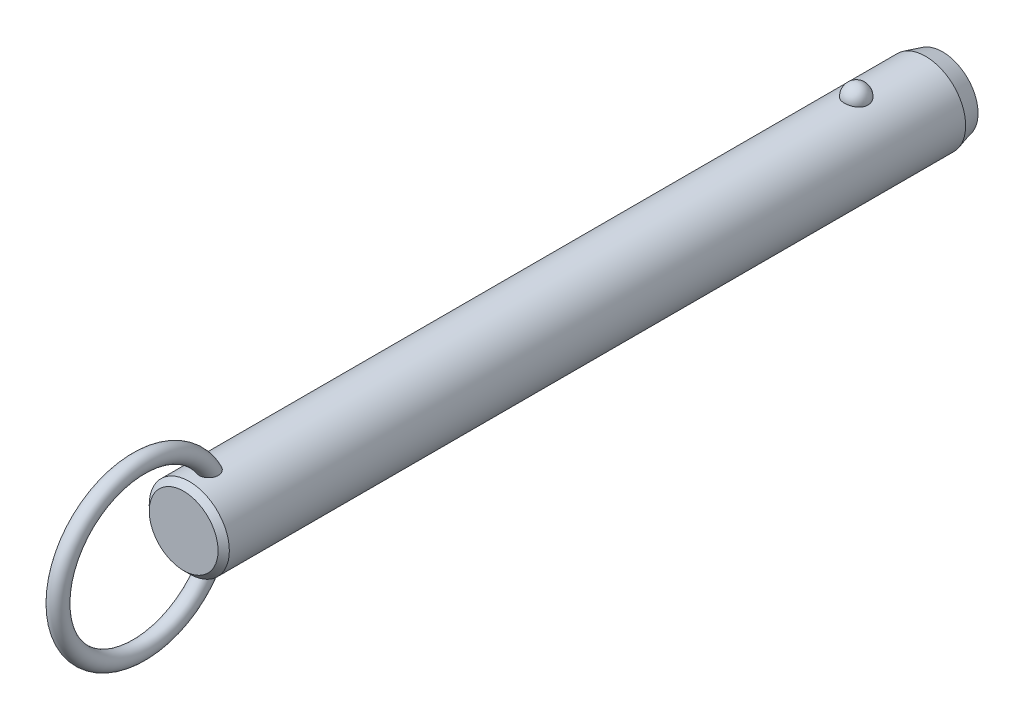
ISO-10303-21;
HEADER;
FILE_DESCRIPTION(('STEP AP214'),'2;1');
FILE_NAME('part.step','',(''),(''),'','','');
FILE_SCHEMA(('AUTOMOTIVE_DESIGN { 1 0 10303 214 1 1 1 1 }'));
ENDSEC;
DATA;
#1=APPLICATION_CONTEXT('core data for automotive mechanical design processes');
#2=APPLICATION_PROTOCOL_DEFINITION('international standard','automotive_design',2000,#1);
#3=PRODUCT_CONTEXT('',#1,'mechanical');
#4=PRODUCT('Part','Part','',(#3));
#5=PRODUCT_RELATED_PRODUCT_CATEGORY('part','',(#4));
#6=PRODUCT_DEFINITION_FORMATION('','',#4);
#7=PRODUCT_DEFINITION_CONTEXT('part definition',#1,'design');
#8=PRODUCT_DEFINITION('design','',#6,#7);
#9=PRODUCT_DEFINITION_SHAPE('','',#8);
#10=(LENGTH_UNIT() NAMED_UNIT(*) SI_UNIT(.MILLI.,.METRE.));
#11=(NAMED_UNIT(*) PLANE_ANGLE_UNIT() SI_UNIT($,.RADIAN.));
#12=(NAMED_UNIT(*) SI_UNIT($,.STERADIAN.) SOLID_ANGLE_UNIT());
#13=UNCERTAINTY_MEASURE_WITH_UNIT(LENGTH_MEASURE(1.E-05),#10,'distance_accuracy_value','');
#14=(GEOMETRIC_REPRESENTATION_CONTEXT(3) GLOBAL_UNCERTAINTY_ASSIGNED_CONTEXT((#13)) GLOBAL_UNIT_ASSIGNED_CONTEXT((#10,
#11,#12)) REPRESENTATION_CONTEXT('',''));
#15=CARTESIAN_POINT('',(0.,0.,0.));
#16=DIRECTION('',(0.,0.,1.));
#17=DIRECTION('',(1.,0.,0.));
#18=AXIS2_PLACEMENT_3D('',#15,#16,#17);
#19=CARTESIAN_POINT('',(0.,0.,109.2));
#20=DIRECTION('',(0.,0.,-1.));
#21=DIRECTION('',(-1.,0.,0.));
#22=AXIS2_PLACEMENT_3D('',#19,#20,#21);
#23=CYLINDRICAL_SURFACE('',#22,7.1);
#24=CARTESIAN_POINT('',(2.0769088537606,6.78943661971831,-2.1));
#25=CARTESIAN_POINT('',(2.07690739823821,6.78943796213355,-1.98268154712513));
#26=CARTESIAN_POINT('',(2.06738130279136,6.79237331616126,-1.86534506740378));
#27=CARTESIAN_POINT('',(2.0295040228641,6.8037853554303,-1.63400788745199));
#28=CARTESIAN_POINT('',(2.00114757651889,6.81226358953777,-1.52000812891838));
#29=CARTESIAN_POINT('',(1.92632025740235,6.83379798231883,-1.29863433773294));
#30=CARTESIAN_POINT('',(1.87985726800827,6.84685214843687,-1.19125744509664));
#31=CARTESIAN_POINT('',(1.76995205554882,6.87608091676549,-0.98604657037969));
#32=CARTESIAN_POINT('',(1.70650980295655,6.8922555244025,-0.88821260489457));
#33=CARTESIAN_POINT('',(1.5638119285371,6.92602930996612,-0.704242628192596));
#34=CARTESIAN_POINT('',(1.4844714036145,6.94363582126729,-0.618173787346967));
#35=CARTESIAN_POINT('',(1.31221746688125,6.97823658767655,-0.460740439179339));
#36=CARTESIAN_POINT('',(1.21930409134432,6.99523084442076,-0.389375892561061));
#37=CARTESIAN_POINT('',(1.02268781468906,7.02666176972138,-0.263547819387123));
#38=CARTESIAN_POINT('',(0.91902009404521,7.04110638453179,-0.209031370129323));
#39=CARTESIAN_POINT('',(0.703548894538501,7.06588726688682,-0.118163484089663));
#40=CARTESIAN_POINT('',(0.591746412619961,7.07622403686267,-0.0818098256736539));
#41=CARTESIAN_POINT('',(0.365557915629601,7.09147068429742,-0.0288711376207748));
#42=CARTESIAN_POINT('',(0.251267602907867,7.09648447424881,-0.0119070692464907));
#43=CARTESIAN_POINT('',(0.0213499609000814,7.10089837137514,0.00304925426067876));
#44=CARTESIAN_POINT('',(-0.0942772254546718,7.10029907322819,0.00104351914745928));
#45=CARTESIAN_POINT('',(-0.321651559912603,7.09360829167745,-0.0216931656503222));
#46=CARTESIAN_POINT('',(-0.433431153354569,7.08760388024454,-0.0421272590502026));
#47=CARTESIAN_POINT('',(-0.651862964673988,7.07086131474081,-0.100729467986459));
#48=CARTESIAN_POINT('',(-0.758515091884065,7.06012307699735,-0.138897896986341));
#49=CARTESIAN_POINT('',(-0.964449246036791,7.03496097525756,-0.232213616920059));
#50=CARTESIAN_POINT('',(-1.06368095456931,7.02051445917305,-0.287465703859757));
#51=CARTESIAN_POINT('',(-1.25145353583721,6.98948740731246,-0.413383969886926));
#52=CARTESIAN_POINT('',(-1.33999321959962,6.97290663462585,-0.48405186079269));
#53=CARTESIAN_POINT('',(-1.50591604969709,6.93898770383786,-0.640594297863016));
#54=CARTESIAN_POINT('',(-1.58302488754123,6.92164094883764,-0.726757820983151));
#55=CARTESIAN_POINT('',(-1.72189320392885,6.8884103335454,-0.91092752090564));
#56=CARTESIAN_POINT('',(-1.78365144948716,6.87252659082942,-1.008934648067));
#57=CARTESIAN_POINT('',(-1.89101272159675,6.84377189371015,-1.21549497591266));
#58=CARTESIAN_POINT('',(-1.93639553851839,6.83094274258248,-1.32416860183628));
#59=CARTESIAN_POINT('',(-2.00874275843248,6.81002070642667,-1.54791500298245));
#60=CARTESIAN_POINT('',(-2.03570774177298,6.80192767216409,-1.66298757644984));
#61=CARTESIAN_POINT('',(-2.07047276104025,6.7914266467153,-1.89571453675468));
#62=CARTESIAN_POINT('',(-2.07835878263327,6.78899315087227,-2.01335491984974));
#63=CARTESIAN_POINT('',(-2.07502083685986,6.79001409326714,-2.24833570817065));
#64=CARTESIAN_POINT('',(-2.06379746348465,6.7934683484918,-2.36567612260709));
#65=CARTESIAN_POINT('',(-2.02263913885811,6.80583442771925,-2.59603194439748));
#66=CARTESIAN_POINT('',(-1.99281127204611,6.81471501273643,-2.70906820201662));
#67=CARTESIAN_POINT('',(-1.91526639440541,6.83691232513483,-2.92836575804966));
#68=CARTESIAN_POINT('',(-1.8675486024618,6.85022924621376,-3.03462676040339));
#69=CARTESIAN_POINT('',(-1.75504492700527,6.87991336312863,-3.23806487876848));
#70=CARTESIAN_POINT('',(-1.69015924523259,6.89629822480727,-3.33518422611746));
#71=CARTESIAN_POINT('',(-1.54505404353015,6.93024852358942,-3.51697105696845));
#72=CARTESIAN_POINT('',(-1.46483385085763,6.94781401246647,-3.60163799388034));
#73=CARTESIAN_POINT('',(-1.29071406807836,6.98225977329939,-3.75654119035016));
#74=CARTESIAN_POINT('',(-1.19675650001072,6.99913673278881,-3.82671308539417));
#75=CARTESIAN_POINT('',(-0.997940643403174,7.03023618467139,-3.9501837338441));
#76=CARTESIAN_POINT('',(-0.89308318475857,7.04445887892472,-4.00348377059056));
#77=CARTESIAN_POINT('',(-0.676902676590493,7.06848365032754,-4.09107242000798));
#78=CARTESIAN_POINT('',(-0.565686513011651,7.0783430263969,-4.12560889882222));
#79=CARTESIAN_POINT('',(-0.338739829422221,7.09282534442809,-4.17575450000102));
#80=CARTESIAN_POINT('',(-0.223009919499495,7.09744899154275,-4.19136617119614));
#81=CARTESIAN_POINT('',(0.00707628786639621,7.10090930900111,-4.20307965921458));
#82=CARTESIAN_POINT('',(0.121410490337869,7.09986531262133,-4.19958377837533));
#83=CARTESIAN_POINT('',(0.347815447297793,7.092380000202,-4.17411564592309));
#84=CARTESIAN_POINT('',(0.459886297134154,7.08593891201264,-4.15214417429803));
#85=CARTESIAN_POINT('',(0.678084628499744,7.06838983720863,-4.09049562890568));
#86=CARTESIAN_POINT('',(0.784237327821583,7.05730369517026,-4.05090137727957));
#87=CARTESIAN_POINT('',(0.988305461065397,7.03163139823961,-3.95511447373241));
#88=CARTESIAN_POINT('',(1.08622031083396,7.01704499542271,-3.89892064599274));
#89=CARTESIAN_POINT('',(1.27284490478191,6.98562668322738,-3.77035541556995));
#90=CARTESIAN_POINT('',(1.36137372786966,6.96876135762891,-3.69772964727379));
#91=CARTESIAN_POINT('',(1.52509486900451,6.93477412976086,-3.53878279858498));
#92=CARTESIAN_POINT('',(1.60028496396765,6.91765218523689,-3.45245943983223));
#93=CARTESIAN_POINT('',(1.73681688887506,6.88465753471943,-3.26658774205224));
#94=CARTESIAN_POINT('',(1.79785966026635,6.86881574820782,-3.16681408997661));
#95=CARTESIAN_POINT('',(1.90265327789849,6.84053157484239,-2.95814408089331));
#96=CARTESIAN_POINT('',(1.94640861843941,6.82808830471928,-2.84925010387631));
#97=CARTESIAN_POINT('',(2.01274378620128,6.80881460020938,-2.63454318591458));
#98=CARTESIAN_POINT('',(2.03676193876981,6.80160856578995,-2.52920574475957));
#99=CARTESIAN_POINT('',(2.06884490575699,6.79191902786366,-2.3159172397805));
#100=CARTESIAN_POINT('',(2.07691019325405,6.78943538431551,-2.20796625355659));
#101=CARTESIAN_POINT('',(2.0769088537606,6.78943661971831,-2.1));
#102=B_SPLINE_CURVE_WITH_KNOTS('',3,(#24,#25,#26,#27,#28,#29,#30,#31,#32,#33,#34,#35,#36,#37,
#38,#39,#40,#41,#42,#43,#44,#45,#46,#47,#48,#49,#50,#51,#52,#53,#54,#55,#56,#57,#58,#59,#60,#61,
#62,#63,#64,#65,#66,#67,#68,#69,#70,#71,#72,#73,#74,#75,#76,#77,#78,#79,#80,#81,#82,#83,#84,#85,
#86,#87,#88,#89,#90,#91,#92,#93,#94,#95,#96,#97,#98,#99,#100,#101),.UNSPECIFIED.,.T.,.F.,(4,2,2,
2,2,2,2,2,2,2,2,2,2,2,2,2,2,2,2,2,2,2,2,2,2,2,2,2,2,2,2,2,2,2,2,2,2,2,4),(0.,0.351568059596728,
0.703234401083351,1.05474780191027,1.40626181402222,1.75970563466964,2.11314851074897,
2.4654696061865,2.81774759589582,3.16301449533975,3.50824481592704,3.84801136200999,
4.18778391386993,4.52968352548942,4.87162112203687,5.22076181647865,5.56993054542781,
5.92363364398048,6.27732559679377,6.62942052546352,6.98150450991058,7.33158042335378,
7.68167162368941,8.03384443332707,8.38603269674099,8.73975272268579,9.09344583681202,
9.44234545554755,9.79119807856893,10.1327344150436,10.4742563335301,10.8141898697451,
11.1541474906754,11.4997793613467,11.8454687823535,12.1979079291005,12.5502553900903,
12.8738073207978,13.1973496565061),.UNSPECIFIED.);
#103=CARTESIAN_POINT('',(2.0769088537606,6.78943661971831,-2.1));
#104=VERTEX_POINT('',#103);
#105=EDGE_CURVE('E41',#104,#104,#102,.T.);
#106=ORIENTED_EDGE('',*,*,#105,.T.);
#107=EDGE_LOOP('',(#106));
#108=FACE_BOUND('',#107,.T.);
#109=CARTESIAN_POINT('',(0.,0.,116.12));
#110=DIRECTION('',(0.,0.,1.));
#111=DIRECTION('',(1.,0.,0.));
#112=AXIS2_PLACEMENT_3D('',#109,#110,#111);
#113=CIRCLE('',#112,7.1);
#114=CARTESIAN_POINT('',(7.1,0.,116.12));
#115=VERTEX_POINT('',#114);
#116=EDGE_CURVE('E10',#115,#115,#113,.F.);
#117=ORIENTED_EDGE('',*,*,#116,.T.);
#118=EDGE_LOOP('',(#117));
#119=FACE_BOUND('',#118,.T.);
#120=CARTESIAN_POINT('',(-0.429539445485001,-7.08699541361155,110.942921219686));
#121=CARTESIAN_POINT('',(-0.508331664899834,-7.08221999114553,110.966876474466));
#122=CARTESIAN_POINT('',(-0.585039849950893,-7.07624016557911,110.997457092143));
#123=CARTESIAN_POINT('',(-0.732082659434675,-7.06254296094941,111.071024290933));
#124=CARTESIAN_POINT('',(-0.802417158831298,-7.05482554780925,111.114011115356));
#125=CARTESIAN_POINT('',(-0.934722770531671,-7.03851844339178,111.211113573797));
#126=CARTESIAN_POINT('',(-0.996700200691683,-7.02992941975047,111.265220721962));
#127=CARTESIAN_POINT('',(-1.11079942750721,-7.01280697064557,111.382967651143));
#128=CARTESIAN_POINT('',(-1.16292136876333,-7.00427354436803,111.446607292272));
#129=CARTESIAN_POINT('',(-1.25705660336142,-6.98799959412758,111.582687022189));
#130=CARTESIAN_POINT('',(-1.29888032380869,-6.98027525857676,111.655259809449));
#131=CARTESIAN_POINT('',(-1.37069920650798,-6.96652886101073,111.806168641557));
#132=CARTESIAN_POINT('',(-1.40069157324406,-6.96050720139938,111.884506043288));
#133=CARTESIAN_POINT('',(-1.45043507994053,-6.95031881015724,112.050190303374));
#134=CARTESIAN_POINT('',(-1.46937115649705,-6.94630231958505,112.137789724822));
#135=CARTESIAN_POINT('',(-1.49424917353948,-6.94099239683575,112.314871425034));
#136=CARTESIAN_POINT('',(-1.50018601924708,-6.93970003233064,112.404354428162));
#137=CARTESIAN_POINT('',(-1.49978214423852,-6.93978815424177,112.594060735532));
#138=CARTESIAN_POINT('',(-1.49187639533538,-6.94150934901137,112.694279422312));
#139=CARTESIAN_POINT('',(-1.46177925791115,-6.94790814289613,112.892479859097));
#140=CARTESIAN_POINT('',(-1.43957541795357,-6.95258831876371,112.990459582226));
#141=CARTESIAN_POINT('',(-1.37783293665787,-6.96510647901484,113.19536292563));
#142=CARTESIAN_POINT('',(-1.33634073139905,-6.97328848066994,113.301680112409));
#143=CARTESIAN_POINT('',(-1.23686994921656,-6.99161706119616,113.506177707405));
#144=CARTESIAN_POINT('',(-1.17889192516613,-7.00176357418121,113.604358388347));
#145=CARTESIAN_POINT('',(-1.05875124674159,-7.02082898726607,113.772374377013));
#146=CARTESIAN_POINT('',(-0.999247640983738,-7.02963746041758,113.844123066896));
#147=CARTESIAN_POINT('',(-0.869494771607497,-7.04686074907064,113.977195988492));
#148=CARTESIAN_POINT('',(-0.799263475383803,-7.05527619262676,114.038537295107));
#149=CARTESIAN_POINT('',(-0.665408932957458,-7.06899457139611,114.135131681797));
#150=CARTESIAN_POINT('',(-0.603817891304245,-7.07457275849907,114.173151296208));
#151=CARTESIAN_POINT('',(-0.47517283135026,-7.08437420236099,114.238758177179));
#152=CARTESIAN_POINT('',(-0.408123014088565,-7.08859848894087,114.266353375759));
#153=CARTESIAN_POINT('',(-0.269431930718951,-7.09522749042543,114.309256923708));
#154=CARTESIAN_POINT('',(-0.19775731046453,-7.09761688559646,114.324461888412));
#155=CARTESIAN_POINT('',(-0.0527849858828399,-7.10017268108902,114.340716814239));
#156=CARTESIAN_POINT('',(0.0205115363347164,-7.10034065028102,114.341776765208));
#157=CARTESIAN_POINT('',(0.156426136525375,-7.09855986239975,114.330461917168));
#158=CARTESIAN_POINT('',(0.219199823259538,-7.09688191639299,114.319806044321));
#159=CARTESIAN_POINT('',(0.342134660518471,-7.09201880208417,114.288537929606));
#160=CARTESIAN_POINT('',(0.402295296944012,-7.08883333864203,114.267923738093));
#161=CARTESIAN_POINT('',(0.520687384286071,-7.08113868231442,114.217212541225));
#162=CARTESIAN_POINT('',(0.57879126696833,-7.07658958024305,114.186827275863));
#163=CARTESIAN_POINT('',(0.690173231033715,-7.06659708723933,114.118367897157));
#164=CARTESIAN_POINT('',(0.74344785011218,-7.061153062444,114.080288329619));
#165=CARTESIAN_POINT('',(0.870947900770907,-7.04680292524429,113.976592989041));
#166=CARTESIAN_POINT('',(0.941828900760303,-7.0375580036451,113.906897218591));
#167=CARTESIAN_POINT('',(1.07136606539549,-7.01900793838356,113.756945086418));
#168=CARTESIAN_POINT('',(1.13000013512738,-7.00970271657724,113.676670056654));
#169=CARTESIAN_POINT('',(1.23579584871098,-6.99183327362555,113.506899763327));
#170=CARTESIAN_POINT('',(1.28274271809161,-6.98328455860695,113.417269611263));
#171=CARTESIAN_POINT('',(1.36351442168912,-6.96796352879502,113.232176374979));
#172=CARTESIAN_POINT('',(1.39733971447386,-6.96119115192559,113.136713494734));
#173=CARTESIAN_POINT('',(1.45579181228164,-6.94922464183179,112.92530928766));
#174=CARTESIAN_POINT('',(1.47790145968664,-6.94449000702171,112.808631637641));
#175=CARTESIAN_POINT('',(1.50168752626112,-6.93938731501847,112.573015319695));
#176=CARTESIAN_POINT('',(1.50336085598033,-6.93901991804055,112.45407631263));
#177=CARTESIAN_POINT('',(1.48486516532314,-6.9430010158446,112.22360799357));
#178=CARTESIAN_POINT('',(1.46573441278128,-6.9471253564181,112.111995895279));
#179=CARTESIAN_POINT('',(1.40606892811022,-6.95944667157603,111.894886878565));
#180=CARTESIAN_POINT('',(1.36556446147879,-6.96763788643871,111.7893815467));
#181=CARTESIAN_POINT('',(1.27082700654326,-6.98548038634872,111.604287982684));
#182=CARTESIAN_POINT('',(1.21949810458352,-6.99473841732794,111.523171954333));
#183=CARTESIAN_POINT('',(1.10242050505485,-7.01414069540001,111.372227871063));
#184=CARTESIAN_POINT('',(1.0366811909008,-7.02428436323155,111.30239252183));
#185=CARTESIAN_POINT('',(0.900559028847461,-7.04295285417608,111.183573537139));
#186=CARTESIAN_POINT('',(0.831428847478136,-7.05153466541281,111.133157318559));
#187=CARTESIAN_POINT('',(0.685291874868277,-7.06723150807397,111.045142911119));
#188=CARTESIAN_POINT('',(0.608287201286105,-7.0743469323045,111.007541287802));
#189=CARTESIAN_POINT('',(0.451878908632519,-7.08602232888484,110.947491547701));
#190=CARTESIAN_POINT('',(0.372686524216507,-7.09067127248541,110.924508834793));
#191=CARTESIAN_POINT('',(0.211477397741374,-7.09730788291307,110.892035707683));
#192=CARTESIAN_POINT('',(0.12946098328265,-7.09929585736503,110.88254373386));
#193=CARTESIAN_POINT('',(-0.0332905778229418,-7.10037858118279,110.877351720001));
#194=CARTESIAN_POINT('',(-0.114016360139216,-7.09953334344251,110.881365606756));
#195=CARTESIAN_POINT('',(-0.273670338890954,-7.09517338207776,110.902454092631));
#196=CARTESIAN_POINT('',(-0.352598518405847,-7.09165863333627,110.919528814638));
#197=CARTESIAN_POINT('',(-0.429539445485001,-7.08699541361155,110.942921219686));
#198=B_SPLINE_CURVE_WITH_KNOTS('',3,(#120,#121,#122,#123,#124,#125,#126,#127,#128,#129,#130,
#131,#132,#133,#134,#135,#136,#137,#138,#139,#140,#141,#142,#143,#144,#145,#146,#147,#148,#149,
#150,#151,#152,#153,#154,#155,#156,#157,#158,#159,#160,#161,#162,#163,#164,#165,#166,#167,#168,
#169,#170,#171,#172,#173,#174,#175,#176,#177,#178,#179,#180,#181,#182,#183,#184,#185,#186,#187,
#188,#189,#190,#191,#192,#193,#194,#195,#196,#197),.UNSPECIFIED.,.T.,.F.,(4,2,2,2,2,2,2,2,2,2,2,
2,2,2,2,2,2,2,2,2,2,2,2,2,2,2,2,2,2,2,2,2,2,2,2,2,2,2,4),(0.,0.247183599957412,
0.494372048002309,0.741372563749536,0.988369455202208,1.23962059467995,1.49093106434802,
1.75897818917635,2.02713035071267,2.32758265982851,2.62829697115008,2.97008736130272,
3.31186629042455,3.59175319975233,3.87117637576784,4.08813841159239,4.30493502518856,
4.52352259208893,4.7419557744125,4.93215328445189,5.12238804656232,5.31884850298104,
5.51544871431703,5.8133231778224,6.11173048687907,6.41527266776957,6.71880423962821,
7.073581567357,7.42841252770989,7.76631485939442,8.10373999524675,8.39142246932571,
8.67891817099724,8.93560332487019,9.19221962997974,9.43881106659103,9.68537399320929,
9.92674752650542,10.1681233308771),.UNSPECIFIED.);
#199=CARTESIAN_POINT('',(-0.429539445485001,-7.08699541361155,110.942921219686));
#200=VERTEX_POINT('',#199);
#201=EDGE_CURVE('E60',#200,#200,#198,.T.);
#202=ORIENTED_EDGE('',*,*,#201,.T.);
#203=EDGE_LOOP('',(#202));
#204=FACE_BOUND('',#203,.T.);
#205=CARTESIAN_POINT('',(-0.429539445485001,7.08699541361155,110.942921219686));
#206=CARTESIAN_POINT('',(-0.351665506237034,7.09171429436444,110.919246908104));
#207=CARTESIAN_POINT('',(-0.271733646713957,7.09525896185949,110.902036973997));
#208=CARTESIAN_POINT('',(-0.110026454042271,7.09960839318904,110.881005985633));
#209=CARTESIAN_POINT('',(-0.0282502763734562,7.10041187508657,110.877191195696));
#210=CARTESIAN_POINT('',(0.134782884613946,7.09918849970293,110.883059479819));
#211=CARTESIAN_POINT('',(0.21603995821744,7.09716214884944,110.89274013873));
#212=CARTESIAN_POINT('',(0.375730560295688,7.09050177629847,110.925347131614));
#213=CARTESIAN_POINT('',(0.454164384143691,7.08586802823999,110.948272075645));
#214=CARTESIAN_POINT('',(0.606025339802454,7.07449911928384,111.006771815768));
#215=CARTESIAN_POINT('',(0.679451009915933,7.06776334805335,111.042350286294));
#216=CARTESIAN_POINT('',(0.81923414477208,7.05292866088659,111.125175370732));
#217=CARTESIAN_POINT('',(0.885591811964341,7.04482978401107,111.172421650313));
#218=CARTESIAN_POINT('',(1.00993211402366,7.02808709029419,111.277590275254));
#219=CARTESIAN_POINT('',(1.06785399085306,7.01943990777,111.335583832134));
#220=CARTESIAN_POINT('',(1.17342527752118,7.00256662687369,111.460301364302));
#221=CARTESIAN_POINT('',(1.22107408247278,6.99434055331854,111.527025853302));
#222=CARTESIAN_POINT('',(1.30652927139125,6.97889183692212,111.669362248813));
#223=CARTESIAN_POINT('',(1.34399711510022,6.97170674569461,111.745180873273));
#224=CARTESIAN_POINT('',(1.40682616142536,6.95930080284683,111.901810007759));
#225=CARTESIAN_POINT('',(1.43218374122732,6.95408053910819,111.98262200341));
#226=CARTESIAN_POINT('',(1.47246409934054,6.94566853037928,112.153531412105));
#227=CARTESIAN_POINT('',(1.48642590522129,6.9426653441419,112.24386307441));
#228=CARTESIAN_POINT('',(1.5011410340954,6.93949744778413,112.425619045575));
#229=CARTESIAN_POINT('',(1.50188917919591,6.93933385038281,112.517043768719));
#230=CARTESIAN_POINT('',(1.49030464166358,6.94183245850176,112.71084381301));
#231=CARTESIAN_POINT('',(1.47627413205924,6.94486147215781,112.813112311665));
#232=CARTESIAN_POINT('',(1.43356351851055,6.95380194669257,113.014471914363));
#233=CARTESIAN_POINT('',(1.40486768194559,6.95971650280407,113.113559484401));
#234=CARTESIAN_POINT('',(1.32908750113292,6.97461208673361,113.318908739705));
#235=CARTESIAN_POINT('',(1.28011435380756,6.98388945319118,113.424456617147));
#236=CARTESIAN_POINT('',(1.16520357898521,7.00397743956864,113.625760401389));
#237=CARTESIAN_POINT('',(1.09927694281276,7.01478706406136,113.721522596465));
#238=CARTESIAN_POINT('',(0.969361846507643,7.03373936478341,113.876756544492));
#239=CARTESIAN_POINT('',(0.909042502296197,7.04187023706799,113.939303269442));
#240=CARTESIAN_POINT('',(0.779178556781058,7.05741732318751,114.054053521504));
#241=CARTESIAN_POINT('',(0.709649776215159,7.06483472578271,114.106274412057));
#242=CARTESIAN_POINT('',(0.576854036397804,7.0767751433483,114.188113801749));
#243=CARTESIAN_POINT('',(0.515118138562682,7.08158033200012,114.220164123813));
#244=CARTESIAN_POINT('',(0.387127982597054,7.08972701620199,114.273765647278));
#245=CARTESIAN_POINT('',(0.320877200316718,7.09306962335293,114.295324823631));
#246=CARTESIAN_POINT('',(0.18504126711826,7.09791507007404,114.326400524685));
#247=CARTESIAN_POINT('',(0.115437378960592,7.09940591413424,114.335838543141));
#248=CARTESIAN_POINT('',(-0.024315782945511,7.10030171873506,114.341522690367));
#249=CARTESIAN_POINT('',(-0.0944648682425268,7.0997073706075,114.337773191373));
#250=CARTESIAN_POINT('',(-0.225713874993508,7.09668414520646,114.318508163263));
#251=CARTESIAN_POINT('',(-0.287006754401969,7.09444865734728,114.304232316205));
#252=CARTESIAN_POINT('',(-0.406555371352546,7.08860360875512,114.266368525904));
#253=CARTESIAN_POINT('',(-0.464809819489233,7.08499346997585,114.242776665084));
#254=CARTESIAN_POINT('',(-0.594955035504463,7.07541654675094,114.178923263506));
#255=CARTESIAN_POINT('',(-0.665389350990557,7.06906574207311,114.135753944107));
#256=CARTESIAN_POINT('',(-0.798242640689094,7.05530261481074,114.038587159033));
#257=CARTESIAN_POINT('',(-0.860645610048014,7.0478882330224,113.984568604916));
#258=CARTESIAN_POINT('',(-0.99424943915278,7.03045217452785,113.850996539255));
#259=CARTESIAN_POINT('',(-1.06260129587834,7.02030745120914,113.768614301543));
#260=CARTESIAN_POINT('',(-1.18502045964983,7.00068382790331,113.593843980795));
#261=CARTESIAN_POINT('',(-1.239076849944,6.99120544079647,113.501448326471));
#262=CARTESIAN_POINT('',(-1.33335589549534,6.97384343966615,113.308008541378));
#263=CARTESIAN_POINT('',(-1.3733613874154,6.96598557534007,113.206856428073));
#264=CARTESIAN_POINT('',(-1.43770677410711,6.9529905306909,112.999504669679));
#265=CARTESIAN_POINT('',(-1.46204473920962,6.94785368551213,112.89330440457));
#266=CARTESIAN_POINT('',(-1.49537533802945,6.94076296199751,112.668231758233));
#267=CARTESIAN_POINT('',(-1.50273564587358,6.93914842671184,112.54909751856));
#268=CARTESIAN_POINT('',(-1.4954555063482,6.94072368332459,112.311470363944));
#269=CARTESIAN_POINT('',(-1.48082914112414,6.94391040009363,112.192977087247));
#270=CARTESIAN_POINT('',(-1.43076401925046,6.95438579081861,111.973432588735));
#271=CARTESIAN_POINT('',(-1.39762227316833,6.96121852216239,111.871841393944));
#272=CARTESIAN_POINT('',(-1.31211274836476,6.97783941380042,111.677351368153));
#273=CARTESIAN_POINT('',(-1.2597660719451,6.98762432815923,111.58444313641));
#274=CARTESIAN_POINT('',(-1.14583073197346,7.00713153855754,111.424160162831));
#275=CARTESIAN_POINT('',(-1.0866594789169,7.01665982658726,111.355035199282));
#276=CARTESIAN_POINT('',(-0.956606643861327,7.03556646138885,111.228878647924));
#277=CARTESIAN_POINT('',(-0.885737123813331,7.04494495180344,111.171834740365));
#278=CARTESIAN_POINT('',(-0.751558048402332,7.06035735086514,111.083100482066));
#279=CARTESIAN_POINT('',(-0.690120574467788,7.0666695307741,111.048593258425));
#280=CARTESIAN_POINT('',(-0.562815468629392,7.07794609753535,110.988750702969));
#281=CARTESIAN_POINT('',(-0.496948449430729,7.08291067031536,110.963414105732));
#282=CARTESIAN_POINT('',(-0.429539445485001,7.08699541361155,110.942921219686));
#283=B_SPLINE_CURVE_WITH_KNOTS('',3,(#205,#206,#207,#208,#209,#210,#211,#212,#213,#214,#215,
#216,#217,#218,#219,#220,#221,#222,#223,#224,#225,#226,#227,#228,#229,#230,#231,#232,#233,#234,
#235,#236,#237,#238,#239,#240,#241,#242,#243,#244,#245,#246,#247,#248,#249,#250,#251,#252,#253,
#254,#255,#256,#257,#258,#259,#260,#261,#262,#263,#264,#265,#266,#267,#268,#269,#270,#271,#272,
#273,#274,#275,#276,#277,#278,#279,#280,#281,#282),.UNSPECIFIED.,.T.,.F.,(4,2,2,2,2,2,2,2,2,2,2,
2,2,2,2,2,2,2,2,2,2,2,2,2,2,2,2,2,2,2,2,2,2,2,2,2,2,2,4),(0.,0.244335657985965,
0.488785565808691,0.73319173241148,0.977572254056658,1.22202379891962,1.46646834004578,
1.71259457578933,1.95873529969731,2.21226768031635,2.46587585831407,2.73913816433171,
3.01250754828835,3.3210993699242,3.63002293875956,3.9786351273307,4.32702187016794,
4.58793945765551,4.84841449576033,5.05676704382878,5.26496096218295,5.47449661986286,
5.68396281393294,5.87205447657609,6.06022532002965,6.30743751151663,6.55513496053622,
6.87602468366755,7.19715875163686,7.52305774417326,7.84899686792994,8.20516155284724,
8.56109821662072,8.88040084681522,9.19935367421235,9.4723628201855,9.74509220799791,
9.95662250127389,10.1681235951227),.UNSPECIFIED.);
#284=CARTESIAN_POINT('',(-0.429539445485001,7.08699541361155,110.942921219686));
#285=VERTEX_POINT('',#284);
#286=EDGE_CURVE('E68',#285,#285,#283,.T.);
#287=ORIENTED_EDGE('',*,*,#286,.T.);
#288=EDGE_LOOP('',(#287));
#289=FACE_BOUND('',#288,.T.);
#290=CARTESIAN_POINT('',(0.,0.,-14.4));
#291=DIRECTION('',(0.,0.,-1.));
#292=DIRECTION('',(-1.,0.,0.));
#293=AXIS2_PLACEMENT_3D('',#290,#291,#292);
#294=CIRCLE('',#293,7.1);
#295=CARTESIAN_POINT('',(-7.1,0.,-14.4));
#296=VERTEX_POINT('',#295);
#297=EDGE_CURVE('E57',#296,#296,#294,.F.);
#298=ORIENTED_EDGE('',*,*,#297,.T.);
#299=EDGE_LOOP('',(#298));
#300=FACE_BOUND('',#299,.T.);
#301=ADVANCED_FACE('F37',(#108,#119,#204,#289,#300),#23,.T.);
#302=CARTESIAN_POINT('',(0.,0.,-17.4));
#303=DIRECTION('',(0.,0.,-1.));
#304=DIRECTION('',(-1.,0.,0.));
#305=AXIS2_PLACEMENT_3D('',#302,#303,#304);
#306=PLANE('',#305);
#307=CARTESIAN_POINT('',(0.,0.,-17.4));
#308=DIRECTION('',(0.,0.,-1.));
#309=DIRECTION('',(-1.,0.,0.));
#310=AXIS2_PLACEMENT_3D('',#307,#308,#309);
#311=CIRCLE('',#310,6.29615242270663);
#312=CARTESIAN_POINT('',(-6.29615242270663,0.,-17.4));
#313=VERTEX_POINT('',#312);
#314=EDGE_CURVE('E67',#313,#313,#311,.T.);
#315=ORIENTED_EDGE('',*,*,#314,.T.);
#316=EDGE_LOOP('',(#315));
#317=FACE_BOUND('',#316,.T.);
#318=ADVANCED_FACE('F86',(#317),#306,.T.);
#319=CARTESIAN_POINT('',(0.,0.,-17.4));
#320=DIRECTION('',(0.,0.,1.));
#321=DIRECTION('',(1.,0.,0.));
#322=AXIS2_PLACEMENT_3D('',#319,#320,#321);
#323=CONICAL_SURFACE('',#322,6.29615242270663,0.261799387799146);
#324=ORIENTED_EDGE('',*,*,#297,.F.);
#325=EDGE_LOOP('',(#324));
#326=FACE_BOUND('',#325,.T.);
#327=ORIENTED_EDGE('',*,*,#314,.F.);
#328=EDGE_LOOP('',(#327));
#329=FACE_BOUND('',#328,.T.);
#330=ADVANCED_FACE('F84',(#326,#329),#323,.T.);
#331=CARTESIAN_POINT('',(0.,0.,117.12));
#332=DIRECTION('',(0.,0.,1.));
#333=DIRECTION('',(1.,0.,0.));
#334=AXIS2_PLACEMENT_3D('',#331,#332,#333);
#335=PLANE('',#334);
#336=CARTESIAN_POINT('',(0.,0.,117.12));
#337=DIRECTION('',(0.,0.,1.));
#338=DIRECTION('',(1.,0.,0.));
#339=AXIS2_PLACEMENT_3D('',#336,#337,#338);
#340=CIRCLE('',#339,6.10000000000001);
#341=CARTESIAN_POINT('',(6.10000000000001,0.,117.12));
#342=VERTEX_POINT('',#341);
#343=EDGE_CURVE('E50',#342,#342,#340,.T.);
#344=ORIENTED_EDGE('',*,*,#343,.T.);
#345=EDGE_LOOP('',(#344));
#346=FACE_BOUND('',#345,.T.);
#347=ADVANCED_FACE('F78',(#346),#335,.T.);
#348=CARTESIAN_POINT('',(0.,0.,125.05));
#349=DIRECTION('',(1.,0.,0.));
#350=DIRECTION('',(0.,0.,-1.));
#351=AXIS2_PLACEMENT_3D('',#348,#349,#350);
#352=TOROIDAL_SURFACE('',#351,14.35,1.5);
#353=ORIENTED_EDGE('',*,*,#286,.F.);
#354=EDGE_LOOP('',(#353));
#355=FACE_BOUND('',#354,.T.);
#356=ORIENTED_EDGE('',*,*,#201,.F.);
#357=EDGE_LOOP('',(#356));
#358=FACE_BOUND('',#357,.T.);
#359=ADVANCED_FACE('F74',(#355,#358),#352,.T.);
#360=CARTESIAN_POINT('',(0.,0.,117.12));
#361=DIRECTION('',(0.,0.,-1.));
#362=DIRECTION('',(-1.,0.,0.));
#363=AXIS2_PLACEMENT_3D('',#360,#361,#362);
#364=CONICAL_SURFACE('',#363,6.10000000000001,0.78539816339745);
#365=ORIENTED_EDGE('',*,*,#116,.F.);
#366=EDGE_LOOP('',(#365));
#367=FACE_BOUND('',#366,.T.);
#368=ORIENTED_EDGE('',*,*,#343,.F.);
#369=EDGE_LOOP('',(#368));
#370=FACE_BOUND('',#369,.T.);
#371=ADVANCED_FACE('F39',(#367,#370),#364,.T.);
#372=CARTESIAN_POINT('',(0.,7.1,-2.1));
#373=DIRECTION('',(0.,1.,0.));
#374=DIRECTION('',(0.,0.,1.));
#375=AXIS2_PLACEMENT_3D('',#372,#373,#374);
#376=SPHERICAL_SURFACE('',#375,2.10000000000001);
#377=ORIENTED_EDGE('',*,*,#105,.F.);
#378=EDGE_LOOP('',(#377));
#379=FACE_BOUND('',#378,.T.);
#380=ADVANCED_FACE('F80',(#379),#376,.T.);
#381=CLOSED_SHELL('',(#301,#318,#330,#347,#359,#371,#380));
#382=MANIFOLD_SOLID_BREP('B2',#381);
#383=ADVANCED_BREP_SHAPE_REPRESENTATION('',(#18,#382),#14);
#384=SHAPE_DEFINITION_REPRESENTATION(#9,#383);
ENDSEC;
END-ISO-10303-21;
